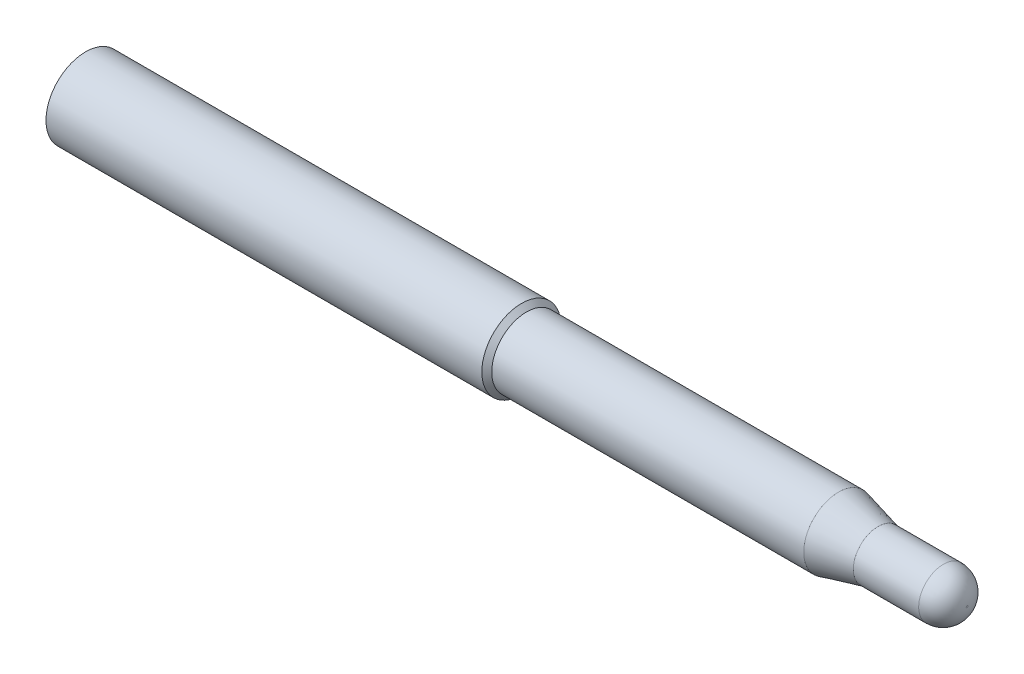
from build123d import *

# Parameters (mm, degrees)
ZAOBLIT1_R = 1.2


with BuildPart() as part:
    # Skica1 → Rotovat1 (revolve)
    with BuildSketch(Plane.XY):
        Polygon((0, 0), (0, 2), (22, 2), (22.25, 1.75), (38, 1.75), (40, 1.25), (44.5, 1.25), (44.5, 0), align=None)
    revolve(axis=Axis((44.5, 0, 0), (-1, 0, 0)))

    # Zaoblit1
    zaoblit1_edges = [part.edges().sort_by_distance(p)[0] for p in [
        (44.5, -1.25, 0),
    ]]
    fillet(zaoblit1_edges, radius=ZAOBLIT1_R)


solid = part.part
